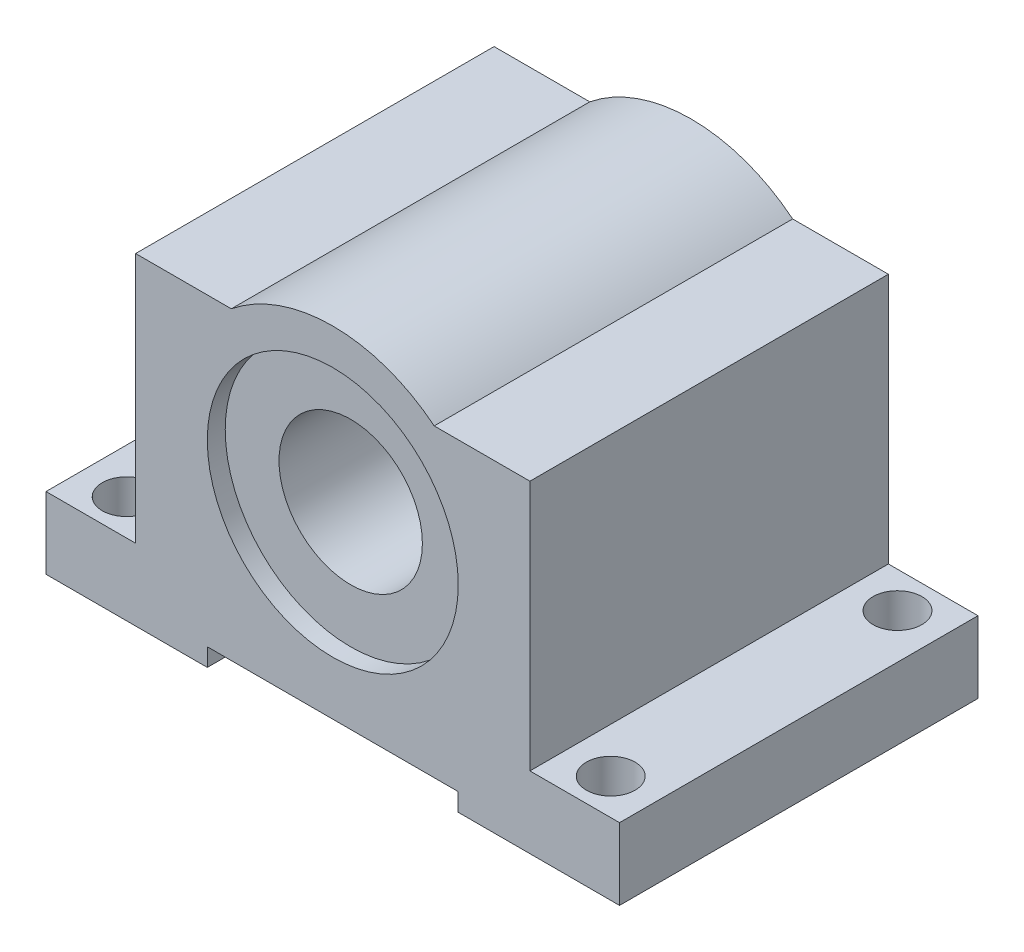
ISO-10303-21;
HEADER;
FILE_DESCRIPTION(('STEP AP214'),'2;1');
FILE_NAME('part.step','',(''),(''),'','','');
FILE_SCHEMA(('AUTOMOTIVE_DESIGN { 1 0 10303 214 1 1 1 1 }'));
ENDSEC;
DATA;
#1=APPLICATION_CONTEXT('core data for automotive mechanical design processes');
#2=APPLICATION_PROTOCOL_DEFINITION('international standard','automotive_design',2000,#1);
#3=PRODUCT_CONTEXT('',#1,'mechanical');
#4=PRODUCT('Part','Part','',(#3));
#5=PRODUCT_RELATED_PRODUCT_CATEGORY('part','',(#4));
#6=PRODUCT_DEFINITION_FORMATION('','',#4);
#7=PRODUCT_DEFINITION_CONTEXT('part definition',#1,'design');
#8=PRODUCT_DEFINITION('design','',#6,#7);
#9=PRODUCT_DEFINITION_SHAPE('','',#8);
#10=(LENGTH_UNIT() NAMED_UNIT(*) SI_UNIT(.MILLI.,.METRE.));
#11=(NAMED_UNIT(*) PLANE_ANGLE_UNIT() SI_UNIT($,.RADIAN.));
#12=(NAMED_UNIT(*) SI_UNIT($,.STERADIAN.) SOLID_ANGLE_UNIT());
#13=UNCERTAINTY_MEASURE_WITH_UNIT(LENGTH_MEASURE(1.E-05),#10,'distance_accuracy_value','');
#14=(GEOMETRIC_REPRESENTATION_CONTEXT(3) GLOBAL_UNCERTAINTY_ASSIGNED_CONTEXT((#13)) GLOBAL_UNIT_ASSIGNED_CONTEXT((#10,
#11,#12)) REPRESENTATION_CONTEXT('',''));
#15=CARTESIAN_POINT('',(0.,0.,0.));
#16=DIRECTION('',(0.,0.,1.));
#17=DIRECTION('',(1.,0.,0.));
#18=AXIS2_PLACEMENT_3D('',#15,#16,#17);
#19=CARTESIAN_POINT('',(-25.4,0.,15.875));
#20=DIRECTION('',(0.,1.,0.));
#21=DIRECTION('',(0.,0.,1.));
#22=AXIS2_PLACEMENT_3D('',#19,#20,#21);
#23=PLANE('',#22);
#24=CARTESIAN_POINT('',(-21.43125,0.,12.7));
#25=DIRECTION('',(0.,1.,0.));
#26=DIRECTION('',(0.,0.,1.));
#27=AXIS2_PLACEMENT_3D('',#24,#25,#26);
#28=CIRCLE('',#27,2.159);
#29=CARTESIAN_POINT('',(-21.43125,0.,14.859));
#30=VERTEX_POINT('',#29);
#31=EDGE_CURVE('E289',#30,#30,#28,.T.);
#32=ORIENTED_EDGE('',*,*,#31,.T.);
#33=EDGE_LOOP('',(#32));
#34=FACE_BOUND('',#33,.T.);
#35=CARTESIAN_POINT('',(-21.43125,0.,-12.7));
#36=DIRECTION('',(0.,1.,0.));
#37=DIRECTION('',(0.,0.,1.));
#38=AXIS2_PLACEMENT_3D('',#35,#36,#37);
#39=CIRCLE('',#38,2.159);
#40=CARTESIAN_POINT('',(-21.43125,0.,-10.541));
#41=VERTEX_POINT('',#40);
#42=EDGE_CURVE('E283',#41,#41,#39,.T.);
#43=ORIENTED_EDGE('',*,*,#42,.T.);
#44=EDGE_LOOP('',(#43));
#45=FACE_BOUND('',#44,.T.);
#46=DIRECTION('',(1.,0.,0.));
#47=VECTOR('',#46,1.);
#48=CARTESIAN_POINT('',(-25.4,0.,-15.875));
#49=LINE('',#48,#47);
#50=CARTESIAN_POINT('',(-25.4,0.,-15.875));
#51=VERTEX_POINT('',#50);
#52=CARTESIAN_POINT('',(-11.1125,0.,-15.875));
#53=VERTEX_POINT('',#52);
#54=EDGE_CURVE('E153',#51,#53,#49,.T.);
#55=ORIENTED_EDGE('',*,*,#54,.T.);
#56=DIRECTION('',(0.,0.,1.));
#57=VECTOR('',#56,1.);
#58=CARTESIAN_POINT('',(-11.1125,0.,-15.875));
#59=LINE('',#58,#57);
#60=CARTESIAN_POINT('',(-11.1125,0.,15.875));
#61=VERTEX_POINT('',#60);
#62=EDGE_CURVE('E138',#53,#61,#59,.T.);
#63=ORIENTED_EDGE('',*,*,#62,.T.);
#64=DIRECTION('',(1.,0.,0.));
#65=VECTOR('',#64,1.);
#66=CARTESIAN_POINT('',(-25.4,0.,15.875));
#67=LINE('',#66,#65);
#68=CARTESIAN_POINT('',(-25.4,0.,15.875));
#69=VERTEX_POINT('',#68);
#70=EDGE_CURVE('E151',#69,#61,#67,.T.);
#71=ORIENTED_EDGE('',*,*,#70,.F.);
#72=DIRECTION('',(0.,0.,-1.));
#73=VECTOR('',#72,1.);
#74=CARTESIAN_POINT('',(-25.4,0.,15.875));
#75=LINE('',#74,#73);
#76=EDGE_CURVE('E165',#69,#51,#75,.T.);
#77=ORIENTED_EDGE('',*,*,#76,.T.);
#78=EDGE_LOOP('',(#55,#63,#71,#77));
#79=FACE_BOUND('',#78,.T.);
#80=ADVANCED_FACE('F30',(#34,#45,#79),#23,.F.);
#81=CARTESIAN_POINT('',(0.,17.4498,-15.875));
#82=DIRECTION('',(0.,0.,1.));
#83=DIRECTION('',(1.,0.,0.));
#84=AXIS2_PLACEMENT_3D('',#81,#82,#83);
#85=CYLINDRICAL_SURFACE('',#84,6.35);
#86=CARTESIAN_POINT('',(0.,17.4498,14.2875));
#87=DIRECTION('',(0.,0.,1.));
#88=DIRECTION('',(1.,0.,0.));
#89=AXIS2_PLACEMENT_3D('',#86,#87,#88);
#90=CIRCLE('',#89,6.35);
#91=CARTESIAN_POINT('',(6.35,17.4498,14.2875));
#92=VERTEX_POINT('',#91);
#93=EDGE_CURVE('E184',#92,#92,#90,.F.);
#94=ORIENTED_EDGE('',*,*,#93,.F.);
#95=EDGE_LOOP('',(#94));
#96=FACE_BOUND('',#95,.T.);
#97=CARTESIAN_POINT('',(0.,17.4498,-14.2875));
#98=DIRECTION('',(0.,0.,-1.));
#99=DIRECTION('',(-1.,0.,0.));
#100=AXIS2_PLACEMENT_3D('',#97,#98,#99);
#101=CIRCLE('',#100,6.35);
#102=CARTESIAN_POINT('',(-6.35,17.4498,-14.2875));
#103=VERTEX_POINT('',#102);
#104=EDGE_CURVE('E34',#103,#103,#101,.F.);
#105=ORIENTED_EDGE('',*,*,#104,.F.);
#106=EDGE_LOOP('',(#105));
#107=FACE_BOUND('',#106,.T.);
#108=ADVANCED_FACE('F303',(#96,#107),#85,.F.);
#109=CARTESIAN_POINT('',(25.4,28.575,-15.875));
#110=DIRECTION('',(0.,0.,1.));
#111=DIRECTION('',(1.,0.,0.));
#112=AXIS2_PLACEMENT_3D('',#109,#110,#111);
#113=PLANE('',#112);
#114=DIRECTION('',(-1.,0.,0.));
#115=VECTOR('',#114,1.);
#116=CARTESIAN_POINT('',(-11.1125,1.5875,-15.875));
#117=LINE('',#116,#115);
#118=CARTESIAN_POINT('',(11.1125,1.5875,-15.875));
#119=VERTEX_POINT('',#118);
#120=CARTESIAN_POINT('',(-11.1125,1.5875,-15.875));
#121=VERTEX_POINT('',#120);
#122=EDGE_CURVE('E154',#119,#121,#117,.T.);
#123=ORIENTED_EDGE('',*,*,#122,.T.);
#124=DIRECTION('',(0.,-1.,0.));
#125=VECTOR('',#124,1.);
#126=CARTESIAN_POINT('',(-11.1125,0.,-15.875));
#127=LINE('',#126,#125);
#128=EDGE_CURVE('E253',#121,#53,#127,.T.);
#129=ORIENTED_EDGE('',*,*,#128,.T.);
#130=ORIENTED_EDGE('',*,*,#54,.F.);
#131=DIRECTION('',(0.,-1.,0.));
#132=VECTOR('',#131,1.);
#133=CARTESIAN_POINT('',(-25.4,0.,-15.875));
#134=LINE('',#133,#132);
#135=CARTESIAN_POINT('',(-25.4,6.34999999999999,-15.875));
#136=VERTEX_POINT('',#135);
#137=EDGE_CURVE('E223',#136,#51,#134,.T.);
#138=ORIENTED_EDGE('',*,*,#137,.F.);
#139=DIRECTION('',(-1.,0.,0.));
#140=VECTOR('',#139,1.);
#141=CARTESIAN_POINT('',(-25.4,6.34999999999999,-15.875));
#142=LINE('',#141,#140);
#143=CARTESIAN_POINT('',(-17.4625,6.34999999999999,-15.875));
#144=VERTEX_POINT('',#143);
#145=EDGE_CURVE('E221',#144,#136,#142,.T.);
#146=ORIENTED_EDGE('',*,*,#145,.F.);
#147=DIRECTION('',(0.,-1.,0.));
#148=VECTOR('',#147,1.);
#149=CARTESIAN_POINT('',(-17.4625,6.34999999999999,-15.875));
#150=LINE('',#149,#148);
#151=CARTESIAN_POINT('',(-17.4625,28.575,-15.875));
#152=VERTEX_POINT('',#151);
#153=EDGE_CURVE('E219',#152,#144,#150,.T.);
#154=ORIENTED_EDGE('',*,*,#153,.F.);
#155=DIRECTION('',(-1.,0.,0.));
#156=VECTOR('',#155,1.);
#157=CARTESIAN_POINT('',(17.4625,28.575,-15.875));
#158=LINE('',#157,#156);
#159=CARTESIAN_POINT('',(-8.98474512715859,28.575,-15.875));
#160=VERTEX_POINT('',#159);
#161=EDGE_CURVE('E216',#160,#152,#158,.T.);
#162=ORIENTED_EDGE('',*,*,#161,.F.);
#163=CARTESIAN_POINT('',(0.,17.4498,-15.875));
#164=DIRECTION('',(0.,0.,1.));
#165=DIRECTION('',(1.,0.,0.));
#166=AXIS2_PLACEMENT_3D('',#163,#164,#165);
#167=CIRCLE('',#166,14.3002);
#168=CARTESIAN_POINT('',(8.98474512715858,28.575,-15.875));
#169=VERTEX_POINT('',#168);
#170=EDGE_CURVE('E186',#160,#169,#167,.F.);
#171=ORIENTED_EDGE('',*,*,#170,.T.);
#172=CARTESIAN_POINT('',(17.4625,28.575,-15.875));
#173=VERTEX_POINT('',#172);
#174=EDGE_CURVE('E217',#173,#169,#158,.T.);
#175=ORIENTED_EDGE('',*,*,#174,.F.);
#176=DIRECTION('',(0.,1.,0.));
#177=VECTOR('',#176,1.);
#178=CARTESIAN_POINT('',(17.4625,6.34999999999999,-15.875));
#179=LINE('',#178,#177);
#180=CARTESIAN_POINT('',(17.4625,6.34999999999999,-15.875));
#181=VERTEX_POINT('',#180);
#182=EDGE_CURVE('E214',#181,#173,#179,.T.);
#183=ORIENTED_EDGE('',*,*,#182,.F.);
#184=DIRECTION('',(-1.,0.,0.));
#185=VECTOR('',#184,1.);
#186=CARTESIAN_POINT('',(25.4,6.34999999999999,-15.875));
#187=LINE('',#186,#185);
#188=CARTESIAN_POINT('',(25.4,6.34999999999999,-15.875));
#189=VERTEX_POINT('',#188);
#190=EDGE_CURVE('E212',#189,#181,#187,.T.);
#191=ORIENTED_EDGE('',*,*,#190,.F.);
#192=DIRECTION('',(0.,1.,0.));
#193=VECTOR('',#192,1.);
#194=CARTESIAN_POINT('',(25.4,0.,-15.875));
#195=LINE('',#194,#193);
#196=CARTESIAN_POINT('',(25.4,0.,-15.875));
#197=VERTEX_POINT('',#196);
#198=EDGE_CURVE('E209',#197,#189,#195,.T.);
#199=ORIENTED_EDGE('',*,*,#198,.F.);
#200=CARTESIAN_POINT('',(11.1125,0.,-15.875));
#201=VERTEX_POINT('',#200);
#202=EDGE_CURVE('E225',#201,#197,#49,.T.);
#203=ORIENTED_EDGE('',*,*,#202,.F.);
#204=DIRECTION('',(0.,1.,0.));
#205=VECTOR('',#204,1.);
#206=CARTESIAN_POINT('',(11.1125,0.,-15.875));
#207=LINE('',#206,#205);
#208=EDGE_CURVE('E256',#201,#119,#207,.T.);
#209=ORIENTED_EDGE('',*,*,#208,.T.);
#210=EDGE_LOOP('',(#123,#129,#130,#138,#146,#154,#162,#171,#175,#183,#191,#199,#203,#209));
#211=FACE_BOUND('',#210,.T.);
#212=CARTESIAN_POINT('',(0.,17.4498,-15.875));
#213=DIRECTION('',(0.,0.,1.));
#214=DIRECTION('',(1.,0.,0.));
#215=AXIS2_PLACEMENT_3D('',#212,#213,#214);
#216=CIRCLE('',#215,11.1125);
#217=CARTESIAN_POINT('',(11.1125,17.4498,-15.875));
#218=VERTEX_POINT('',#217);
#219=EDGE_CURVE('E292',#218,#218,#216,.T.);
#220=ORIENTED_EDGE('',*,*,#219,.T.);
#221=EDGE_LOOP('',(#220));
#222=FACE_BOUND('',#221,.T.);
#223=ADVANCED_FACE('F251',(#211,#222),#113,.F.);
#224=CARTESIAN_POINT('',(17.4625,28.575,15.875));
#225=DIRECTION('',(0.,-1.,0.));
#226=DIRECTION('',(0.,0.,-1.));
#227=AXIS2_PLACEMENT_3D('',#224,#225,#226);
#228=PLANE('',#227);
#229=DIRECTION('',(0.,0.,-1.));
#230=VECTOR('',#229,1.);
#231=CARTESIAN_POINT('',(-8.98474512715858,28.575,56.3220735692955));
#232=LINE('',#231,#230);
#233=CARTESIAN_POINT('',(-8.98474512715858,28.575,15.875));
#234=VERTEX_POINT('',#233);
#235=EDGE_CURVE('E207',#160,#234,#232,.F.);
#236=ORIENTED_EDGE('',*,*,#235,.F.);
#237=ORIENTED_EDGE('',*,*,#161,.T.);
#238=DIRECTION('',(0.,0.,-1.));
#239=VECTOR('',#238,1.);
#240=CARTESIAN_POINT('',(-17.4625,28.575,15.875));
#241=LINE('',#240,#239);
#242=CARTESIAN_POINT('',(-17.4625,28.575,15.875));
#243=VERTEX_POINT('',#242);
#244=EDGE_CURVE('E177',#243,#152,#241,.T.);
#245=ORIENTED_EDGE('',*,*,#244,.F.);
#246=DIRECTION('',(-1.,0.,0.));
#247=VECTOR('',#246,1.);
#248=CARTESIAN_POINT('',(17.4625,28.575,15.875));
#249=LINE('',#248,#247);
#250=EDGE_CURVE('E55',#234,#243,#249,.T.);
#251=ORIENTED_EDGE('',*,*,#250,.F.);
#252=EDGE_LOOP('',(#236,#237,#245,#251));
#253=FACE_BOUND('',#252,.T.);
#254=ADVANCED_FACE('F311',(#253),#228,.F.);
#255=DIRECTION('',(0.,0.,-1.));
#256=VECTOR('',#255,1.);
#257=CARTESIAN_POINT('',(8.98474512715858,28.575,56.3220735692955));
#258=LINE('',#257,#256);
#259=CARTESIAN_POINT('',(8.98474512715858,28.575,15.875));
#260=VERTEX_POINT('',#259);
#261=EDGE_CURVE('E204',#260,#169,#258,.T.);
#262=ORIENTED_EDGE('',*,*,#261,.F.);
#263=CARTESIAN_POINT('',(17.4625,28.575,15.875));
#264=VERTEX_POINT('',#263);
#265=EDGE_CURVE('E234',#264,#260,#249,.T.);
#266=ORIENTED_EDGE('',*,*,#265,.F.);
#267=DIRECTION('',(0.,0.,-1.));
#268=VECTOR('',#267,1.);
#269=CARTESIAN_POINT('',(17.4625,28.575,15.875));
#270=LINE('',#269,#268);
#271=EDGE_CURVE('E180',#264,#173,#270,.T.);
#272=ORIENTED_EDGE('',*,*,#271,.T.);
#273=ORIENTED_EDGE('',*,*,#174,.T.);
#274=EDGE_LOOP('',(#262,#266,#272,#273));
#275=FACE_BOUND('',#274,.T.);
#276=ADVANCED_FACE('F341',(#275),#228,.F.);
#277=CARTESIAN_POINT('',(25.4,0.,15.875));
#278=DIRECTION('',(-1.,0.,0.));
#279=DIRECTION('',(0.,-1.,0.));
#280=AXIS2_PLACEMENT_3D('',#277,#278,#279);
#281=PLANE('',#280);
#282=ORIENTED_EDGE('',*,*,#198,.T.);
#283=DIRECTION('',(0.,0.,-1.));
#284=VECTOR('',#283,1.);
#285=CARTESIAN_POINT('',(25.4,6.34999999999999,15.875));
#286=LINE('',#285,#284);
#287=CARTESIAN_POINT('',(25.4,6.34999999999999,15.875));
#288=VERTEX_POINT('',#287);
#289=EDGE_CURVE('E11',#288,#189,#286,.T.);
#290=ORIENTED_EDGE('',*,*,#289,.F.);
#291=DIRECTION('',(0.,1.,0.));
#292=VECTOR('',#291,1.);
#293=CARTESIAN_POINT('',(25.4,0.,15.875));
#294=LINE('',#293,#292);
#295=CARTESIAN_POINT('',(25.4,0.,15.875));
#296=VERTEX_POINT('',#295);
#297=EDGE_CURVE('E227',#296,#288,#294,.T.);
#298=ORIENTED_EDGE('',*,*,#297,.F.);
#299=DIRECTION('',(0.,0.,-1.));
#300=VECTOR('',#299,1.);
#301=CARTESIAN_POINT('',(25.4,0.,15.875));
#302=LINE('',#301,#300);
#303=EDGE_CURVE('E161',#296,#197,#302,.T.);
#304=ORIENTED_EDGE('',*,*,#303,.T.);
#305=EDGE_LOOP('',(#282,#290,#298,#304));
#306=FACE_BOUND('',#305,.T.);
#307=ADVANCED_FACE('F32',(#306),#281,.F.);
#308=CARTESIAN_POINT('',(25.4,6.34999999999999,15.875));
#309=DIRECTION('',(0.,-1.,0.));
#310=DIRECTION('',(0.,0.,-1.));
#311=AXIS2_PLACEMENT_3D('',#308,#309,#310);
#312=PLANE('',#311);
#313=CARTESIAN_POINT('',(21.44395,6.34999999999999,12.7));
#314=DIRECTION('',(0.,1.,0.));
#315=DIRECTION('',(0.,0.,1.));
#316=AXIS2_PLACEMENT_3D('',#313,#314,#315);
#317=CIRCLE('',#316,2.159);
#318=CARTESIAN_POINT('',(21.44395,6.34999999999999,14.859));
#319=VERTEX_POINT('',#318);
#320=EDGE_CURVE('E265',#319,#319,#317,.T.);
#321=ORIENTED_EDGE('',*,*,#320,.F.);
#322=EDGE_LOOP('',(#321));
#323=FACE_BOUND('',#322,.T.);
#324=CARTESIAN_POINT('',(21.44395,6.34999999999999,-12.7));
#325=DIRECTION('',(0.,1.,0.));
#326=DIRECTION('',(0.,0.,1.));
#327=AXIS2_PLACEMENT_3D('',#324,#325,#326);
#328=CIRCLE('',#327,2.159);
#329=CARTESIAN_POINT('',(21.44395,6.34999999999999,-10.541));
#330=VERTEX_POINT('',#329);
#331=EDGE_CURVE('E274',#330,#330,#328,.T.);
#332=ORIENTED_EDGE('',*,*,#331,.F.);
#333=EDGE_LOOP('',(#332));
#334=FACE_BOUND('',#333,.T.);
#335=ORIENTED_EDGE('',*,*,#190,.T.);
#336=DIRECTION('',(0.,0.,-1.));
#337=VECTOR('',#336,1.);
#338=CARTESIAN_POINT('',(17.4625,6.34999999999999,15.875));
#339=LINE('',#338,#337);
#340=CARTESIAN_POINT('',(17.4625,6.34999999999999,15.875));
#341=VERTEX_POINT('',#340);
#342=EDGE_CURVE('E39',#341,#181,#339,.T.);
#343=ORIENTED_EDGE('',*,*,#342,.F.);
#344=DIRECTION('',(-1.,0.,0.));
#345=VECTOR('',#344,1.);
#346=CARTESIAN_POINT('',(25.4,6.34999999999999,15.875));
#347=LINE('',#346,#345);
#348=EDGE_CURVE('E230',#288,#341,#347,.T.);
#349=ORIENTED_EDGE('',*,*,#348,.F.);
#350=ORIENTED_EDGE('',*,*,#289,.T.);
#351=EDGE_LOOP('',(#335,#343,#349,#350));
#352=FACE_BOUND('',#351,.T.);
#353=ADVANCED_FACE('F343',(#323,#334,#352),#312,.F.);
#354=CARTESIAN_POINT('',(17.4625,6.34999999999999,15.875));
#355=DIRECTION('',(-1.,0.,0.));
#356=DIRECTION('',(0.,0.,1.));
#357=AXIS2_PLACEMENT_3D('',#354,#355,#356);
#358=PLANE('',#357);
#359=ORIENTED_EDGE('',*,*,#182,.T.);
#360=ORIENTED_EDGE('',*,*,#271,.F.);
#361=DIRECTION('',(0.,1.,0.));
#362=VECTOR('',#361,1.);
#363=CARTESIAN_POINT('',(17.4625,6.34999999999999,15.875));
#364=LINE('',#363,#362);
#365=EDGE_CURVE('E232',#341,#264,#364,.T.);
#366=ORIENTED_EDGE('',*,*,#365,.F.);
#367=ORIENTED_EDGE('',*,*,#342,.T.);
#368=EDGE_LOOP('',(#359,#360,#366,#367));
#369=FACE_BOUND('',#368,.T.);
#370=ADVANCED_FACE('F337',(#369),#358,.F.);
#371=CARTESIAN_POINT('',(-17.4625,6.34999999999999,15.875));
#372=DIRECTION('',(1.,0.,0.));
#373=DIRECTION('',(0.,0.,-1.));
#374=AXIS2_PLACEMENT_3D('',#371,#372,#373);
#375=PLANE('',#374);
#376=ORIENTED_EDGE('',*,*,#153,.T.);
#377=DIRECTION('',(0.,0.,-1.));
#378=VECTOR('',#377,1.);
#379=CARTESIAN_POINT('',(-17.4625,6.34999999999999,15.875));
#380=LINE('',#379,#378);
#381=CARTESIAN_POINT('',(-17.4625,6.34999999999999,15.875));
#382=VERTEX_POINT('',#381);
#383=EDGE_CURVE('E174',#382,#144,#380,.T.);
#384=ORIENTED_EDGE('',*,*,#383,.F.);
#385=DIRECTION('',(0.,-1.,0.));
#386=VECTOR('',#385,1.);
#387=CARTESIAN_POINT('',(-17.4625,6.34999999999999,15.875));
#388=LINE('',#387,#386);
#389=EDGE_CURVE('E237',#243,#382,#388,.T.);
#390=ORIENTED_EDGE('',*,*,#389,.F.);
#391=ORIENTED_EDGE('',*,*,#244,.T.);
#392=EDGE_LOOP('',(#376,#384,#390,#391));
#393=FACE_BOUND('',#392,.T.);
#394=ADVANCED_FACE('F333',(#393),#375,.F.);
#395=CARTESIAN_POINT('',(-25.4,6.34999999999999,15.875));
#396=DIRECTION('',(0.,-1.,0.));
#397=DIRECTION('',(0.,0.,-1.));
#398=AXIS2_PLACEMENT_3D('',#395,#396,#397);
#399=PLANE('',#398);
#400=CARTESIAN_POINT('',(-21.43125,6.34999999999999,-12.7));
#401=DIRECTION('',(0.,1.,0.));
#402=DIRECTION('',(0.,0.,1.));
#403=AXIS2_PLACEMENT_3D('',#400,#401,#402);
#404=CIRCLE('',#403,2.159);
#405=CARTESIAN_POINT('',(-21.43125,6.34999999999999,-10.541));
#406=VERTEX_POINT('',#405);
#407=EDGE_CURVE('E280',#406,#406,#404,.T.);
#408=ORIENTED_EDGE('',*,*,#407,.F.);
#409=EDGE_LOOP('',(#408));
#410=FACE_BOUND('',#409,.T.);
#411=CARTESIAN_POINT('',(-21.43125,6.34999999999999,12.7));
#412=DIRECTION('',(0.,1.,0.));
#413=DIRECTION('',(0.,0.,1.));
#414=AXIS2_PLACEMENT_3D('',#411,#412,#413);
#415=CIRCLE('',#414,2.159);
#416=CARTESIAN_POINT('',(-21.43125,6.34999999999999,14.859));
#417=VERTEX_POINT('',#416);
#418=EDGE_CURVE('E286',#417,#417,#415,.T.);
#419=ORIENTED_EDGE('',*,*,#418,.F.);
#420=EDGE_LOOP('',(#419));
#421=FACE_BOUND('',#420,.T.);
#422=ORIENTED_EDGE('',*,*,#145,.T.);
#423=DIRECTION('',(0.,0.,-1.));
#424=VECTOR('',#423,1.);
#425=CARTESIAN_POINT('',(-25.4,6.34999999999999,15.875));
#426=LINE('',#425,#424);
#427=CARTESIAN_POINT('',(-25.4,6.34999999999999,15.875));
#428=VERTEX_POINT('',#427);
#429=EDGE_CURVE('E171',#428,#136,#426,.T.);
#430=ORIENTED_EDGE('',*,*,#429,.F.);
#431=DIRECTION('',(-1.,0.,0.));
#432=VECTOR('',#431,1.);
#433=CARTESIAN_POINT('',(-25.4,6.34999999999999,15.875));
#434=LINE('',#433,#432);
#435=EDGE_CURVE('E238',#382,#428,#434,.T.);
#436=ORIENTED_EDGE('',*,*,#435,.F.);
#437=ORIENTED_EDGE('',*,*,#383,.T.);
#438=EDGE_LOOP('',(#422,#430,#436,#437));
#439=FACE_BOUND('',#438,.T.);
#440=ADVANCED_FACE('F244',(#410,#421,#439),#399,.F.);
#441=CARTESIAN_POINT('',(-25.4,0.,15.875));
#442=DIRECTION('',(1.,0.,0.));
#443=DIRECTION('',(0.,1.,0.));
#444=AXIS2_PLACEMENT_3D('',#441,#442,#443);
#445=PLANE('',#444);
#446=ORIENTED_EDGE('',*,*,#137,.T.);
#447=ORIENTED_EDGE('',*,*,#76,.F.);
#448=DIRECTION('',(0.,-1.,0.));
#449=VECTOR('',#448,1.);
#450=CARTESIAN_POINT('',(-25.4,0.,15.875));
#451=LINE('',#450,#449);
#452=EDGE_CURVE('E159',#428,#69,#451,.T.);
#453=ORIENTED_EDGE('',*,*,#452,.F.);
#454=ORIENTED_EDGE('',*,*,#429,.T.);
#455=EDGE_LOOP('',(#446,#447,#453,#454));
#456=FACE_BOUND('',#455,.T.);
#457=ADVANCED_FACE('F248',(#456),#445,.F.);
#458=CARTESIAN_POINT('',(21.44395,0.,12.7));
#459=DIRECTION('',(0.,1.,0.));
#460=DIRECTION('',(0.,0.,1.));
#461=AXIS2_PLACEMENT_3D('',#458,#459,#460);
#462=CIRCLE('',#461,2.159);
#463=CARTESIAN_POINT('',(21.44395,0.,14.859));
#464=VERTEX_POINT('',#463);
#465=EDGE_CURVE('E271',#464,#464,#462,.T.);
#466=ORIENTED_EDGE('',*,*,#465,.T.);
#467=EDGE_LOOP('',(#466));
#468=FACE_BOUND('',#467,.T.);
#469=CARTESIAN_POINT('',(21.44395,0.,-12.7));
#470=DIRECTION('',(0.,1.,0.));
#471=DIRECTION('',(0.,0.,1.));
#472=AXIS2_PLACEMENT_3D('',#469,#470,#471);
#473=CIRCLE('',#472,2.159);
#474=CARTESIAN_POINT('',(21.44395,0.,-10.541));
#475=VERTEX_POINT('',#474);
#476=EDGE_CURVE('E277',#475,#475,#473,.T.);
#477=ORIENTED_EDGE('',*,*,#476,.T.);
#478=EDGE_LOOP('',(#477));
#479=FACE_BOUND('',#478,.T.);
#480=CARTESIAN_POINT('',(11.1125,0.,15.875));
#481=VERTEX_POINT('',#480);
#482=EDGE_CURVE('E162',#481,#296,#67,.T.);
#483=ORIENTED_EDGE('',*,*,#482,.F.);
#484=DIRECTION('',(0.,0.,1.));
#485=VECTOR('',#484,1.);
#486=CARTESIAN_POINT('',(11.1125,0.,-15.875));
#487=LINE('',#486,#485);
#488=EDGE_CURVE('E47',#201,#481,#487,.T.);
#489=ORIENTED_EDGE('',*,*,#488,.F.);
#490=ORIENTED_EDGE('',*,*,#202,.T.);
#491=ORIENTED_EDGE('',*,*,#303,.F.);
#492=EDGE_LOOP('',(#483,#489,#490,#491));
#493=FACE_BOUND('',#492,.T.);
#494=ADVANCED_FACE('F315',(#468,#479,#493),#23,.F.);
#495=CARTESIAN_POINT('',(25.4,28.575,15.875));
#496=DIRECTION('',(0.,0.,1.));
#497=DIRECTION('',(1.,0.,0.));
#498=AXIS2_PLACEMENT_3D('',#495,#496,#497);
#499=PLANE('',#498);
#500=DIRECTION('',(0.,-1.,0.));
#501=VECTOR('',#500,1.);
#502=CARTESIAN_POINT('',(-11.1125,0.,15.875));
#503=LINE('',#502,#501);
#504=CARTESIAN_POINT('',(-11.1125,1.5875,15.875));
#505=VERTEX_POINT('',#504);
#506=EDGE_CURVE('E134',#505,#61,#503,.T.);
#507=ORIENTED_EDGE('',*,*,#506,.F.);
#508=DIRECTION('',(-1.,0.,0.));
#509=VECTOR('',#508,1.);
#510=CARTESIAN_POINT('',(-11.1125,1.5875,15.875));
#511=LINE('',#510,#509);
#512=CARTESIAN_POINT('',(11.1125,1.5875,15.875));
#513=VERTEX_POINT('',#512);
#514=EDGE_CURVE('E257',#513,#505,#511,.T.);
#515=ORIENTED_EDGE('',*,*,#514,.F.);
#516=DIRECTION('',(0.,1.,0.));
#517=VECTOR('',#516,1.);
#518=CARTESIAN_POINT('',(11.1125,0.,15.875));
#519=LINE('',#518,#517);
#520=EDGE_CURVE('E145',#481,#513,#519,.T.);
#521=ORIENTED_EDGE('',*,*,#520,.F.);
#522=ORIENTED_EDGE('',*,*,#482,.T.);
#523=ORIENTED_EDGE('',*,*,#297,.T.);
#524=ORIENTED_EDGE('',*,*,#348,.T.);
#525=ORIENTED_EDGE('',*,*,#365,.T.);
#526=ORIENTED_EDGE('',*,*,#265,.T.);
#527=CARTESIAN_POINT('',(0.,17.4498,15.875));
#528=DIRECTION('',(0.,0.,1.));
#529=DIRECTION('',(1.,0.,0.));
#530=AXIS2_PLACEMENT_3D('',#527,#528,#529);
#531=CIRCLE('',#530,14.3002);
#532=EDGE_CURVE('E191',#260,#234,#531,.T.);
#533=ORIENTED_EDGE('',*,*,#532,.T.);
#534=ORIENTED_EDGE('',*,*,#250,.T.);
#535=ORIENTED_EDGE('',*,*,#389,.T.);
#536=ORIENTED_EDGE('',*,*,#435,.T.);
#537=ORIENTED_EDGE('',*,*,#452,.T.);
#538=ORIENTED_EDGE('',*,*,#70,.T.);
#539=EDGE_LOOP('',(#507,#515,#521,#522,#523,#524,#525,#526,#533,#534,#535,#536,#537,#538));
#540=FACE_BOUND('',#539,.T.);
#541=CARTESIAN_POINT('',(0.,17.4498,15.875));
#542=DIRECTION('',(0.,0.,1.));
#543=DIRECTION('',(1.,0.,0.));
#544=AXIS2_PLACEMENT_3D('',#541,#542,#543);
#545=CIRCLE('',#544,11.1125);
#546=CARTESIAN_POINT('',(11.1125,17.4498,15.875));
#547=VERTEX_POINT('',#546);
#548=EDGE_CURVE('E194',#547,#547,#545,.T.);
#549=ORIENTED_EDGE('',*,*,#548,.F.);
#550=EDGE_LOOP('',(#549));
#551=FACE_BOUND('',#550,.T.);
#552=ADVANCED_FACE('F156',(#540,#551),#499,.T.);
#553=CARTESIAN_POINT('',(0.,17.4498,56.3220735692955));
#554=DIRECTION('',(0.,0.,-1.));
#555=DIRECTION('',(-1.,0.,0.));
#556=AXIS2_PLACEMENT_3D('',#553,#554,#555);
#557=CYLINDRICAL_SURFACE('',#556,14.3002);
#558=ORIENTED_EDGE('',*,*,#170,.F.);
#559=ORIENTED_EDGE('',*,*,#235,.T.);
#560=ORIENTED_EDGE('',*,*,#532,.F.);
#561=ORIENTED_EDGE('',*,*,#261,.T.);
#562=EDGE_LOOP('',(#558,#559,#560,#561));
#563=FACE_BOUND('',#562,.T.);
#564=ADVANCED_FACE('F320',(#563),#557,.T.);
#565=CARTESIAN_POINT('',(0.,17.4498,14.2875));
#566=DIRECTION('',(0.,0.,1.));
#567=DIRECTION('',(1.,0.,0.));
#568=AXIS2_PLACEMENT_3D('',#565,#566,#567);
#569=PLANE('',#568);
#570=CARTESIAN_POINT('',(0.,17.4498,14.2875));
#571=DIRECTION('',(0.,0.,1.));
#572=DIRECTION('',(1.,0.,0.));
#573=AXIS2_PLACEMENT_3D('',#570,#571,#572);
#574=CIRCLE('',#573,11.1125);
#575=CARTESIAN_POINT('',(11.1125,17.4498,14.2875));
#576=VERTEX_POINT('',#575);
#577=EDGE_CURVE('E187',#576,#576,#574,.T.);
#578=ORIENTED_EDGE('',*,*,#577,.T.);
#579=EDGE_LOOP('',(#578));
#580=FACE_BOUND('',#579,.T.);
#581=ORIENTED_EDGE('',*,*,#93,.T.);
#582=EDGE_LOOP('',(#581));
#583=FACE_BOUND('',#582,.T.);
#584=ADVANCED_FACE('F322',(#580,#583),#569,.T.);
#585=CARTESIAN_POINT('',(0.,17.4498,14.2875));
#586=DIRECTION('',(0.,0.,1.));
#587=DIRECTION('',(1.,0.,0.));
#588=AXIS2_PLACEMENT_3D('',#585,#586,#587);
#589=CYLINDRICAL_SURFACE('',#588,11.1125);
#590=ORIENTED_EDGE('',*,*,#577,.F.);
#591=EDGE_LOOP('',(#590));
#592=FACE_BOUND('',#591,.T.);
#593=ORIENTED_EDGE('',*,*,#548,.T.);
#594=EDGE_LOOP('',(#593));
#595=FACE_BOUND('',#594,.T.);
#596=ADVANCED_FACE('F318',(#592,#595),#589,.F.);
#597=CARTESIAN_POINT('',(0.,17.4498,-14.2875));
#598=DIRECTION('',(0.,0.,-1.));
#599=DIRECTION('',(1.,0.,0.));
#600=AXIS2_PLACEMENT_3D('',#597,#598,#599);
#601=PLANE('',#600);
#602=CARTESIAN_POINT('',(0.,17.4498,-14.2875));
#603=DIRECTION('',(0.,0.,1.));
#604=DIRECTION('',(1.,0.,0.));
#605=AXIS2_PLACEMENT_3D('',#602,#603,#604);
#606=CIRCLE('',#605,11.1125);
#607=CARTESIAN_POINT('',(11.1125,17.4498,-14.2875));
#608=VERTEX_POINT('',#607);
#609=EDGE_CURVE('E294',#608,#608,#606,.T.);
#610=ORIENTED_EDGE('',*,*,#609,.F.);
#611=EDGE_LOOP('',(#610));
#612=FACE_BOUND('',#611,.T.);
#613=ORIENTED_EDGE('',*,*,#104,.T.);
#614=EDGE_LOOP('',(#613));
#615=FACE_BOUND('',#614,.T.);
#616=ADVANCED_FACE('F301',(#612,#615),#601,.T.);
#617=CARTESIAN_POINT('',(0.,17.4498,-14.2875));
#618=DIRECTION('',(0.,0.,-1.));
#619=DIRECTION('',(-1.,0.,0.));
#620=AXIS2_PLACEMENT_3D('',#617,#618,#619);
#621=CYLINDRICAL_SURFACE('',#620,11.1125);
#622=ORIENTED_EDGE('',*,*,#609,.T.);
#623=EDGE_LOOP('',(#622));
#624=FACE_BOUND('',#623,.T.);
#625=ORIENTED_EDGE('',*,*,#219,.F.);
#626=EDGE_LOOP('',(#625));
#627=FACE_BOUND('',#626,.T.);
#628=ADVANCED_FACE('F398',(#624,#627),#621,.F.);
#629=CARTESIAN_POINT('',(-21.43125,0.,12.7));
#630=DIRECTION('',(0.,1.,0.));
#631=DIRECTION('',(0.,0.,1.));
#632=AXIS2_PLACEMENT_3D('',#629,#630,#631);
#633=CYLINDRICAL_SURFACE('',#632,2.159);
#634=ORIENTED_EDGE('',*,*,#31,.F.);
#635=EDGE_LOOP('',(#634));
#636=FACE_BOUND('',#635,.T.);
#637=ORIENTED_EDGE('',*,*,#418,.T.);
#638=EDGE_LOOP('',(#637));
#639=FACE_BOUND('',#638,.T.);
#640=ADVANCED_FACE('F394',(#636,#639),#633,.F.);
#641=CARTESIAN_POINT('',(-21.43125,0.,-12.7));
#642=DIRECTION('',(0.,1.,0.));
#643=DIRECTION('',(0.,0.,1.));
#644=AXIS2_PLACEMENT_3D('',#641,#642,#643);
#645=CYLINDRICAL_SURFACE('',#644,2.159);
#646=ORIENTED_EDGE('',*,*,#42,.F.);
#647=EDGE_LOOP('',(#646));
#648=FACE_BOUND('',#647,.T.);
#649=ORIENTED_EDGE('',*,*,#407,.T.);
#650=EDGE_LOOP('',(#649));
#651=FACE_BOUND('',#650,.T.);
#652=ADVANCED_FACE('F390',(#648,#651),#645,.F.);
#653=CARTESIAN_POINT('',(21.44395,0.,-12.7));
#654=DIRECTION('',(0.,1.,0.));
#655=DIRECTION('',(0.,0.,1.));
#656=AXIS2_PLACEMENT_3D('',#653,#654,#655);
#657=CYLINDRICAL_SURFACE('',#656,2.159);
#658=ORIENTED_EDGE('',*,*,#476,.F.);
#659=EDGE_LOOP('',(#658));
#660=FACE_BOUND('',#659,.T.);
#661=ORIENTED_EDGE('',*,*,#331,.T.);
#662=EDGE_LOOP('',(#661));
#663=FACE_BOUND('',#662,.T.);
#664=ADVANCED_FACE('F386',(#660,#663),#657,.F.);
#665=CARTESIAN_POINT('',(21.44395,0.,12.7));
#666=DIRECTION('',(0.,1.,0.));
#667=DIRECTION('',(0.,0.,1.));
#668=AXIS2_PLACEMENT_3D('',#665,#666,#667);
#669=CYLINDRICAL_SURFACE('',#668,2.159);
#670=ORIENTED_EDGE('',*,*,#465,.F.);
#671=EDGE_LOOP('',(#670));
#672=FACE_BOUND('',#671,.T.);
#673=ORIENTED_EDGE('',*,*,#320,.T.);
#674=EDGE_LOOP('',(#673));
#675=FACE_BOUND('',#674,.T.);
#676=ADVANCED_FACE('F381',(#672,#675),#669,.F.);
#677=CARTESIAN_POINT('',(-11.1125,0.,-15.875));
#678=DIRECTION('',(-1.,0.,0.));
#679=DIRECTION('',(0.,0.,1.));
#680=AXIS2_PLACEMENT_3D('',#677,#678,#679);
#681=PLANE('',#680);
#682=ORIENTED_EDGE('',*,*,#506,.T.);
#683=ORIENTED_EDGE('',*,*,#62,.F.);
#684=ORIENTED_EDGE('',*,*,#128,.F.);
#685=DIRECTION('',(0.,0.,1.));
#686=VECTOR('',#685,1.);
#687=CARTESIAN_POINT('',(-11.1125,1.5875,-15.875));
#688=LINE('',#687,#686);
#689=EDGE_CURVE('E140',#121,#505,#688,.T.);
#690=ORIENTED_EDGE('',*,*,#689,.T.);
#691=EDGE_LOOP('',(#682,#683,#684,#690));
#692=FACE_BOUND('',#691,.T.);
#693=ADVANCED_FACE('F136',(#692),#681,.F.);
#694=CARTESIAN_POINT('',(-11.1125,1.5875,-15.875));
#695=DIRECTION('',(0.,1.,0.));
#696=DIRECTION('',(0.,0.,1.));
#697=AXIS2_PLACEMENT_3D('',#694,#695,#696);
#698=PLANE('',#697);
#699=ORIENTED_EDGE('',*,*,#514,.T.);
#700=ORIENTED_EDGE('',*,*,#689,.F.);
#701=ORIENTED_EDGE('',*,*,#122,.F.);
#702=DIRECTION('',(0.,0.,1.));
#703=VECTOR('',#702,1.);
#704=CARTESIAN_POINT('',(11.1125,1.5875,-15.875));
#705=LINE('',#704,#703);
#706=EDGE_CURVE('E266',#119,#513,#705,.T.);
#707=ORIENTED_EDGE('',*,*,#706,.T.);
#708=EDGE_LOOP('',(#699,#700,#701,#707));
#709=FACE_BOUND('',#708,.T.);
#710=ADVANCED_FACE('F373',(#709),#698,.F.);
#711=CARTESIAN_POINT('',(11.1125,0.,-15.875));
#712=DIRECTION('',(1.,0.,0.));
#713=DIRECTION('',(0.,0.,-1.));
#714=AXIS2_PLACEMENT_3D('',#711,#712,#713);
#715=PLANE('',#714);
#716=ORIENTED_EDGE('',*,*,#520,.T.);
#717=ORIENTED_EDGE('',*,*,#706,.F.);
#718=ORIENTED_EDGE('',*,*,#208,.F.);
#719=ORIENTED_EDGE('',*,*,#488,.T.);
#720=EDGE_LOOP('',(#716,#717,#718,#719));
#721=FACE_BOUND('',#720,.T.);
#722=ADVANCED_FACE('F371',(#721),#715,.F.);
#723=CLOSED_SHELL('',(#80,#108,#223,#254,#276,#307,#353,#370,#394,#440,#457,#494,#552,#564,#584,
#596,#616,#628,#640,#652,#664,#676,#693,#710,#722));
#724=MANIFOLD_SOLID_BREP('B2',#723);
#725=ADVANCED_BREP_SHAPE_REPRESENTATION('',(#18,#724),#14);
#726=SHAPE_DEFINITION_REPRESENTATION(#9,#725);
ENDSEC;
END-ISO-10303-21;
